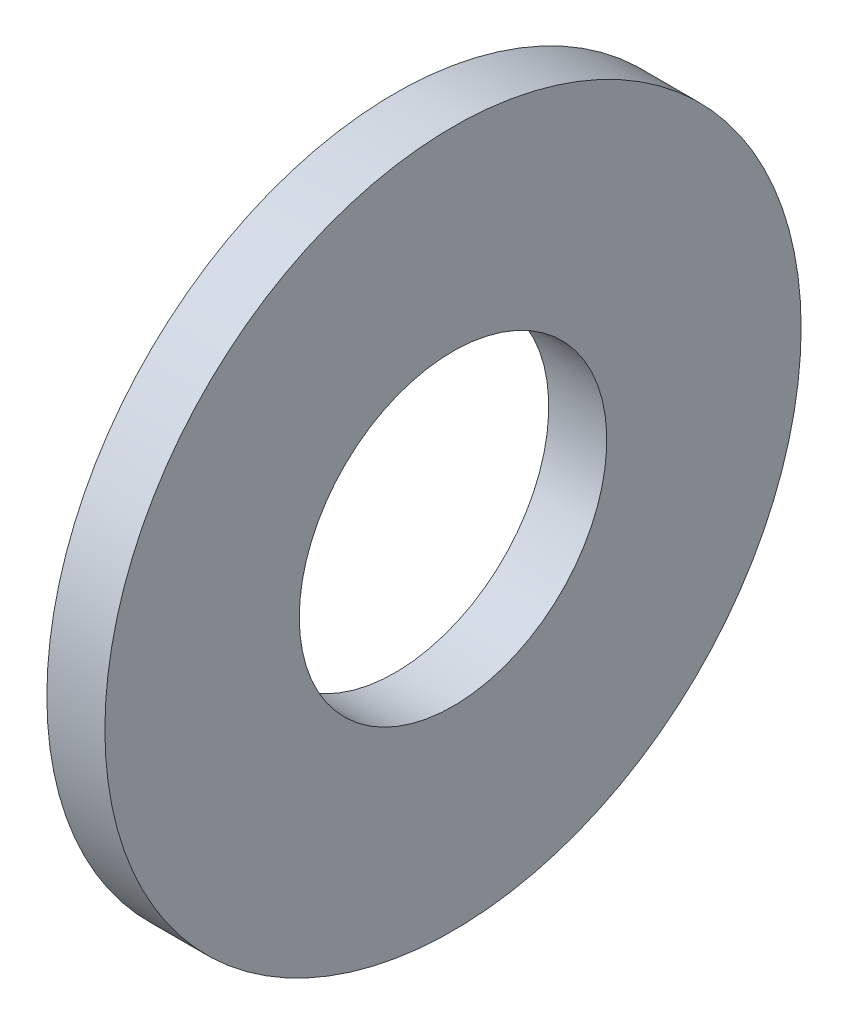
from build123d import *

# Parameters (mm, degrees)
ESQUISSE1_W = 1
ESQUISSE1_H = 3.35


with BuildPart() as part:
    # Esquisse1 → Base-R_volution (revolve)
    with BuildSketch(Plane(origin=(0, 0, 0), x_dir=(1, 0, 0), z_dir=(0, 1, 0)), mode=Mode.PRIVATE) as base_r_volution_sk:
        with Locations((0.5, 4.325)):
            Rectangle(ESQUISSE1_W, ESQUISSE1_H)
    revolve(base_r_volution_sk.sketch.rotate(Axis((0, 0, 0), (1, 0, 0)), 180), axis=Axis((0, 0, 0), (1, 0, 0)))


solid = part.part
